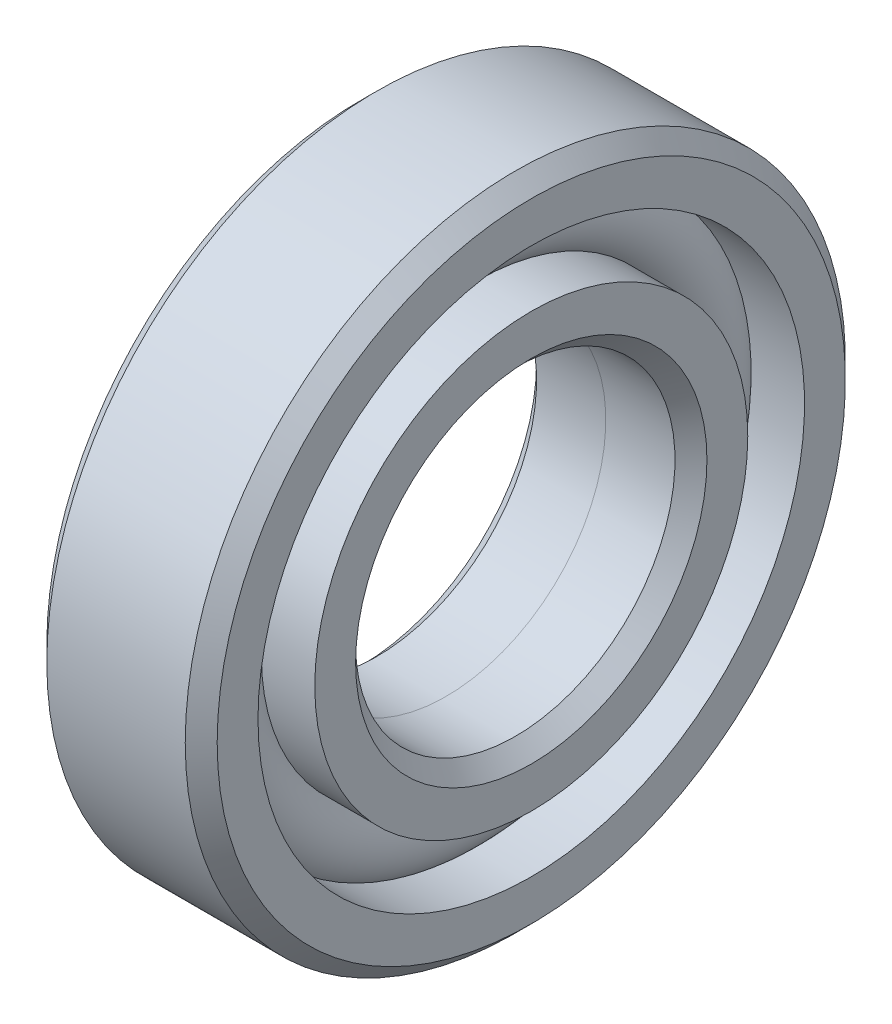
ISO-10303-21;
HEADER;
FILE_DESCRIPTION(('STEP AP214'),'2;1');
FILE_NAME('part.step','',(''),(''),'','','');
FILE_SCHEMA(('AUTOMOTIVE_DESIGN { 1 0 10303 214 1 1 1 1 }'));
ENDSEC;
DATA;
#1=APPLICATION_CONTEXT('core data for automotive mechanical design processes');
#2=APPLICATION_PROTOCOL_DEFINITION('international standard','automotive_design',2000,#1);
#3=PRODUCT_CONTEXT('',#1,'mechanical');
#4=PRODUCT('Part','Part','',(#3));
#5=PRODUCT_RELATED_PRODUCT_CATEGORY('part','',(#4));
#6=PRODUCT_DEFINITION_FORMATION('','',#4);
#7=PRODUCT_DEFINITION_CONTEXT('part definition',#1,'design');
#8=PRODUCT_DEFINITION('design','',#6,#7);
#9=PRODUCT_DEFINITION_SHAPE('','',#8);
#10=(LENGTH_UNIT() NAMED_UNIT(*) SI_UNIT(.MILLI.,.METRE.));
#11=(NAMED_UNIT(*) PLANE_ANGLE_UNIT() SI_UNIT($,.RADIAN.));
#12=(NAMED_UNIT(*) SI_UNIT($,.STERADIAN.) SOLID_ANGLE_UNIT());
#13=UNCERTAINTY_MEASURE_WITH_UNIT(LENGTH_MEASURE(1.E-05),#10,'distance_accuracy_value','');
#14=(GEOMETRIC_REPRESENTATION_CONTEXT(3) GLOBAL_UNCERTAINTY_ASSIGNED_CONTEXT((#13)) GLOBAL_UNIT_ASSIGNED_CONTEXT((#10,
#11,#12)) REPRESENTATION_CONTEXT('',''));
#15=CARTESIAN_POINT('',(0.,0.,0.));
#16=DIRECTION('',(0.,0.,1.));
#17=DIRECTION('',(1.,0.,0.));
#18=AXIS2_PLACEMENT_3D('',#15,#16,#17);
#19=CARTESIAN_POINT('',(8.,0.,0.));
#20=DIRECTION('',(-1.,0.,0.));
#21=DIRECTION('',(0.,0.,1.));
#22=AXIS2_PLACEMENT_3D('',#19,#20,#21);
#23=TOROIDAL_SURFACE('',#22,23.,4.);
#24=CARTESIAN_POINT('',(8.,0.,27.));
#25=VERTEX_POINT('',#24);
#26=VERTEX_LOOP('',#25);
#27=FACE_BOUND('',#26,.T.);
#28=ADVANCED_FACE('F152',(#27),#23,.T.);
#29=CLOSED_SHELL('',(#28));
#30=MANIFOLD_SOLID_BREP('B7',#29);
#31=CARTESIAN_POINT('',(8.,0.,0.));
#32=DIRECTION('',(-1.,0.,0.));
#33=DIRECTION('',(0.,0.,1.));
#34=AXIS2_PLACEMENT_3D('',#31,#32,#33);
#35=TOROIDAL_SURFACE('',#34,23.,4.);
#36=CARTESIAN_POINT('',(5.01857603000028,0.,0.));
#37=DIRECTION('',(-1.,0.,0.));
#38=DIRECTION('',(0.,0.,1.));
#39=AXIS2_PLACEMENT_3D('',#36,#37,#38);
#40=CIRCLE('',#39,25.6666666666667);
#41=CARTESIAN_POINT('',(5.01857603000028,0.,25.6666666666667));
#42=VERTEX_POINT('',#41);
#43=EDGE_CURVE('E215',#42,#42,#40,.T.);
#44=ORIENTED_EDGE('',*,*,#43,.T.);
#45=EDGE_LOOP('',(#44));
#46=FACE_BOUND('',#45,.T.);
#47=CARTESIAN_POINT('',(10.9814239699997,0.,0.));
#48=DIRECTION('',(-1.,0.,0.));
#49=DIRECTION('',(0.,0.,1.));
#50=AXIS2_PLACEMENT_3D('',#47,#48,#49);
#51=CIRCLE('',#50,25.6666666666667);
#52=CARTESIAN_POINT('',(10.9814239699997,0.,25.6666666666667));
#53=VERTEX_POINT('',#52);
#54=EDGE_CURVE('E219',#53,#53,#51,.T.);
#55=ORIENTED_EDGE('',*,*,#54,.F.);
#56=EDGE_LOOP('',(#55));
#57=FACE_BOUND('',#56,.T.);
#58=ADVANCED_FACE('F177',(#46,#57),#35,.F.);
#59=CARTESIAN_POINT('',(0.,0.,0.));
#60=DIRECTION('',(-1.,0.,0.));
#61=DIRECTION('',(0.,0.,1.));
#62=AXIS2_PLACEMENT_3D('',#59,#60,#61);
#63=CYLINDRICAL_SURFACE('',#62,25.6666666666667);
#64=CARTESIAN_POINT('',(16.,0.,0.));
#65=DIRECTION('',(-1.,0.,0.));
#66=DIRECTION('',(0.,0.,1.));
#67=AXIS2_PLACEMENT_3D('',#64,#65,#66);
#68=CIRCLE('',#67,25.6666666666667);
#69=CARTESIAN_POINT('',(16.,0.,25.6666666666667));
#70=VERTEX_POINT('',#69);
#71=EDGE_CURVE('E214',#70,#70,#68,.T.);
#72=ORIENTED_EDGE('',*,*,#71,.F.);
#73=EDGE_LOOP('',(#72));
#74=FACE_BOUND('',#73,.T.);
#75=ORIENTED_EDGE('',*,*,#54,.T.);
#76=EDGE_LOOP('',(#75));
#77=FACE_BOUND('',#76,.T.);
#78=ADVANCED_FACE('F241',(#74,#77),#63,.F.);
#79=CARTESIAN_POINT('',(16.,0.,0.));
#80=DIRECTION('',(-1.,0.,0.));
#81=DIRECTION('',(0.,0.,1.));
#82=AXIS2_PLACEMENT_3D('',#79,#80,#81);
#83=PLANE('',#82);
#84=CARTESIAN_POINT('',(16.,0.,0.));
#85=DIRECTION('',(-1.,0.,0.));
#86=DIRECTION('',(0.,0.,1.));
#87=AXIS2_PLACEMENT_3D('',#84,#85,#86);
#88=CIRCLE('',#87,29.5);
#89=CARTESIAN_POINT('',(16.,0.,29.5));
#90=VERTEX_POINT('',#89);
#91=EDGE_CURVE('E187',#90,#90,#88,.F.);
#92=ORIENTED_EDGE('',*,*,#91,.T.);
#93=EDGE_LOOP('',(#92));
#94=FACE_BOUND('',#93,.T.);
#95=ORIENTED_EDGE('',*,*,#71,.T.);
#96=EDGE_LOOP('',(#95));
#97=FACE_BOUND('',#96,.T.);
#98=ADVANCED_FACE('F247',(#94,#97),#83,.F.);
#99=CARTESIAN_POINT('',(0.,0.,0.));
#100=DIRECTION('',(-1.,0.,0.));
#101=DIRECTION('',(0.,0.,1.));
#102=AXIS2_PLACEMENT_3D('',#99,#100,#101);
#103=CYLINDRICAL_SURFACE('',#102,31.);
#104=CARTESIAN_POINT('',(14.5,0.,0.));
#105=DIRECTION('',(-1.,0.,0.));
#106=DIRECTION('',(0.,0.,1.));
#107=AXIS2_PLACEMENT_3D('',#104,#105,#106);
#108=CIRCLE('',#107,31.);
#109=CARTESIAN_POINT('',(14.5,0.,31.));
#110=VERTEX_POINT('',#109);
#111=EDGE_CURVE('E194',#110,#110,#108,.T.);
#112=ORIENTED_EDGE('',*,*,#111,.T.);
#113=EDGE_LOOP('',(#112));
#114=FACE_BOUND('',#113,.T.);
#115=CARTESIAN_POINT('',(1.50000000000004,0.,0.));
#116=DIRECTION('',(-1.,0.,0.));
#117=DIRECTION('',(0.,0.,1.));
#118=AXIS2_PLACEMENT_3D('',#115,#116,#117);
#119=CIRCLE('',#118,31.);
#120=CARTESIAN_POINT('',(1.50000000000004,0.,31.));
#121=VERTEX_POINT('',#120);
#122=EDGE_CURVE('E199',#121,#121,#119,.F.);
#123=ORIENTED_EDGE('',*,*,#122,.T.);
#124=EDGE_LOOP('',(#123));
#125=FACE_BOUND('',#124,.T.);
#126=ADVANCED_FACE('F230',(#114,#125),#103,.T.);
#127=CARTESIAN_POINT('',(0.,0.,0.));
#128=DIRECTION('',(-1.,0.,0.));
#129=DIRECTION('',(0.,0.,1.));
#130=AXIS2_PLACEMENT_3D('',#127,#128,#129);
#131=PLANE('',#130);
#132=CARTESIAN_POINT('',(0.,0.,0.));
#133=DIRECTION('',(-1.,0.,0.));
#134=DIRECTION('',(0.,0.,1.));
#135=AXIS2_PLACEMENT_3D('',#132,#133,#134);
#136=CIRCLE('',#135,29.5);
#137=CARTESIAN_POINT('',(0.,0.,29.5));
#138=VERTEX_POINT('',#137);
#139=EDGE_CURVE('E151',#138,#138,#136,.T.);
#140=ORIENTED_EDGE('',*,*,#139,.T.);
#141=EDGE_LOOP('',(#140));
#142=FACE_BOUND('',#141,.T.);
#143=CARTESIAN_POINT('',(0.,0.,0.));
#144=DIRECTION('',(-1.,0.,0.));
#145=DIRECTION('',(0.,0.,1.));
#146=AXIS2_PLACEMENT_3D('',#143,#144,#145);
#147=CIRCLE('',#146,25.6666666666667);
#148=CARTESIAN_POINT('',(0.,0.,25.6666666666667));
#149=VERTEX_POINT('',#148);
#150=EDGE_CURVE('E209',#149,#149,#147,.T.);
#151=ORIENTED_EDGE('',*,*,#150,.F.);
#152=EDGE_LOOP('',(#151));
#153=FACE_BOUND('',#152,.T.);
#154=ADVANCED_FACE('F260',(#142,#153),#131,.T.);
#155=CARTESIAN_POINT('',(0.,0.,0.));
#156=DIRECTION('',(-1.,0.,0.));
#157=DIRECTION('',(0.,0.,1.));
#158=AXIS2_PLACEMENT_3D('',#155,#156,#157);
#159=CYLINDRICAL_SURFACE('',#158,25.6666666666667);
#160=ORIENTED_EDGE('',*,*,#43,.F.);
#161=EDGE_LOOP('',(#160));
#162=FACE_BOUND('',#161,.T.);
#163=ORIENTED_EDGE('',*,*,#150,.T.);
#164=EDGE_LOOP('',(#163));
#165=FACE_BOUND('',#164,.T.);
#166=ADVANCED_FACE('F238',(#162,#165),#159,.F.);
#167=CARTESIAN_POINT('',(14.5,0.,0.));
#168=DIRECTION('',(-1.,0.,0.));
#169=DIRECTION('',(0.,0.,1.));
#170=AXIS2_PLACEMENT_3D('',#167,#168,#169);
#171=CONICAL_SURFACE('',#170,31.,0.785398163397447);
#172=ORIENTED_EDGE('',*,*,#91,.F.);
#173=EDGE_LOOP('',(#172));
#174=FACE_BOUND('',#173,.T.);
#175=ORIENTED_EDGE('',*,*,#111,.F.);
#176=EDGE_LOOP('',(#175));
#177=FACE_BOUND('',#176,.T.);
#178=ADVANCED_FACE('F234',(#174,#177),#171,.T.);
#179=CARTESIAN_POINT('',(0.,0.,0.));
#180=DIRECTION('',(1.,0.,0.));
#181=DIRECTION('',(0.,0.,-1.));
#182=AXIS2_PLACEMENT_3D('',#179,#180,#181);
#183=CONICAL_SURFACE('',#182,29.5,0.78539816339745);
#184=ORIENTED_EDGE('',*,*,#122,.F.);
#185=EDGE_LOOP('',(#184));
#186=FACE_BOUND('',#185,.T.);
#187=ORIENTED_EDGE('',*,*,#139,.F.);
#188=EDGE_LOOP('',(#187));
#189=FACE_BOUND('',#188,.T.);
#190=ADVANCED_FACE('F180',(#186,#189),#183,.T.);
#191=CLOSED_SHELL('',(#58,#78,#98,#126,#154,#166,#178,#190));
#192=MANIFOLD_SOLID_BREP('B49',#191);
#193=CARTESIAN_POINT('',(8.,0.,0.));
#194=DIRECTION('',(-1.,0.,0.));
#195=DIRECTION('',(0.,0.,1.));
#196=AXIS2_PLACEMENT_3D('',#193,#194,#195);
#197=TOROIDAL_SURFACE('',#196,23.,4.);
#198=CARTESIAN_POINT('',(10.9814239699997,0.,0.));
#199=DIRECTION('',(-1.,0.,0.));
#200=DIRECTION('',(0.,0.,1.));
#201=AXIS2_PLACEMENT_3D('',#198,#199,#200);
#202=CIRCLE('',#201,20.3333333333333);
#203=CARTESIAN_POINT('',(10.9814239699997,0.,20.3333333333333));
#204=VERTEX_POINT('',#203);
#205=EDGE_CURVE('E377',#204,#204,#202,.T.);
#206=ORIENTED_EDGE('',*,*,#205,.T.);
#207=EDGE_LOOP('',(#206));
#208=FACE_BOUND('',#207,.T.);
#209=CARTESIAN_POINT('',(8.,0.,0.));
#210=DIRECTION('',(-1.,0.,0.));
#211=DIRECTION('',(0.,0.,1.));
#212=AXIS2_PLACEMENT_3D('',#209,#210,#211);
#213=CIRCLE('',#212,19.);
#214=CARTESIAN_POINT('',(8.,0.,19.));
#215=VERTEX_POINT('',#214);
#216=EDGE_CURVE('E356',#215,#215,#213,.T.);
#217=ORIENTED_EDGE('',*,*,#216,.F.);
#218=EDGE_LOOP('',(#217));
#219=FACE_BOUND('',#218,.T.);
#220=ADVANCED_FACE('F342',(#208,#219),#197,.F.);
#221=CARTESIAN_POINT('',(8.,0.,0.));
#222=DIRECTION('',(1.,0.,0.));
#223=DIRECTION('',(0.,0.,-1.));
#224=AXIS2_PLACEMENT_3D('',#221,#222,#223);
#225=PLANE('',#224);
#226=CARTESIAN_POINT('',(8.,0.,0.));
#227=DIRECTION('',(-1.,0.,0.));
#228=DIRECTION('',(0.,0.,1.));
#229=AXIS2_PLACEMENT_3D('',#226,#227,#228);
#230=CIRCLE('',#229,15.);
#231=CARTESIAN_POINT('',(8.,0.,15.));
#232=VERTEX_POINT('',#231);
#233=EDGE_CURVE('E362',#232,#232,#230,.T.);
#234=ORIENTED_EDGE('',*,*,#233,.F.);
#235=EDGE_LOOP('',(#234));
#236=FACE_BOUND('',#235,.T.);
#237=ORIENTED_EDGE('',*,*,#216,.T.);
#238=EDGE_LOOP('',(#237));
#239=FACE_BOUND('',#238,.T.);
#240=ADVANCED_FACE('F399',(#236,#239),#225,.F.);
#241=CARTESIAN_POINT('',(0.,0.,0.));
#242=DIRECTION('',(-1.,0.,0.));
#243=DIRECTION('',(0.,0.,1.));
#244=AXIS2_PLACEMENT_3D('',#241,#242,#243);
#245=CYLINDRICAL_SURFACE('',#244,15.);
#246=CARTESIAN_POINT('',(14.5,0.,0.));
#247=DIRECTION('',(-1.,0.,0.));
#248=DIRECTION('',(0.,0.,1.));
#249=AXIS2_PLACEMENT_3D('',#246,#247,#248);
#250=CIRCLE('',#249,15.);
#251=CARTESIAN_POINT('',(14.5,0.,15.));
#252=VERTEX_POINT('',#251);
#253=EDGE_CURVE('E176',#252,#252,#250,.F.);
#254=ORIENTED_EDGE('',*,*,#253,.T.);
#255=EDGE_LOOP('',(#254));
#256=FACE_BOUND('',#255,.T.);
#257=ORIENTED_EDGE('',*,*,#233,.T.);
#258=EDGE_LOOP('',(#257));
#259=FACE_BOUND('',#258,.T.);
#260=ADVANCED_FACE('F395',(#256,#259),#245,.F.);
#261=CARTESIAN_POINT('',(16.,0.,0.));
#262=DIRECTION('',(-1.,0.,0.));
#263=DIRECTION('',(0.,0.,1.));
#264=AXIS2_PLACEMENT_3D('',#261,#262,#263);
#265=PLANE('',#264);
#266=CARTESIAN_POINT('',(16.,0.,0.));
#267=DIRECTION('',(-1.,0.,0.));
#268=DIRECTION('',(0.,0.,1.));
#269=AXIS2_PLACEMENT_3D('',#266,#267,#268);
#270=CIRCLE('',#269,16.5);
#271=CARTESIAN_POINT('',(16.,0.,16.5));
#272=VERTEX_POINT('',#271);
#273=EDGE_CURVE('E351',#272,#272,#270,.T.);
#274=ORIENTED_EDGE('',*,*,#273,.T.);
#275=EDGE_LOOP('',(#274));
#276=FACE_BOUND('',#275,.T.);
#277=CARTESIAN_POINT('',(16.,0.,0.));
#278=DIRECTION('',(-1.,0.,0.));
#279=DIRECTION('',(0.,0.,1.));
#280=AXIS2_PLACEMENT_3D('',#277,#278,#279);
#281=CIRCLE('',#280,20.3333333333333);
#282=CARTESIAN_POINT('',(16.,0.,20.3333333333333));
#283=VERTEX_POINT('',#282);
#284=EDGE_CURVE('E372',#283,#283,#281,.T.);
#285=ORIENTED_EDGE('',*,*,#284,.F.);
#286=EDGE_LOOP('',(#285));
#287=FACE_BOUND('',#286,.T.);
#288=ADVANCED_FACE('F387',(#276,#287),#265,.F.);
#289=CARTESIAN_POINT('',(0.,0.,0.));
#290=DIRECTION('',(-1.,0.,0.));
#291=DIRECTION('',(0.,0.,1.));
#292=AXIS2_PLACEMENT_3D('',#289,#290,#291);
#293=CYLINDRICAL_SURFACE('',#292,20.3333333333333);
#294=ORIENTED_EDGE('',*,*,#284,.T.);
#295=EDGE_LOOP('',(#294));
#296=FACE_BOUND('',#295,.T.);
#297=ORIENTED_EDGE('',*,*,#205,.F.);
#298=EDGE_LOOP('',(#297));
#299=FACE_BOUND('',#298,.T.);
#300=ADVANCED_FACE('F385',(#296,#299),#293,.T.);
#301=CARTESIAN_POINT('',(16.,0.,0.));
#302=DIRECTION('',(1.,0.,0.));
#303=DIRECTION('',(0.,0.,-1.));
#304=AXIS2_PLACEMENT_3D('',#301,#302,#303);
#305=CONICAL_SURFACE('',#304,16.5,0.785398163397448);
#306=ORIENTED_EDGE('',*,*,#253,.F.);
#307=EDGE_LOOP('',(#306));
#308=FACE_BOUND('',#307,.T.);
#309=ORIENTED_EDGE('',*,*,#273,.F.);
#310=EDGE_LOOP('',(#309));
#311=FACE_BOUND('',#310,.T.);
#312=ADVANCED_FACE('F345',(#308,#311),#305,.F.);
#313=CLOSED_SHELL('',(#220,#240,#260,#288,#300,#312));
#314=MANIFOLD_SOLID_BREP('B146',#313);
#315=CARTESIAN_POINT('',(8.,0.,0.));
#316=DIRECTION('',(-1.,0.,0.));
#317=DIRECTION('',(0.,0.,1.));
#318=AXIS2_PLACEMENT_3D('',#315,#316,#317);
#319=TOROIDAL_SURFACE('',#318,23.,4.);
#320=CARTESIAN_POINT('',(8.,0.,0.));
#321=DIRECTION('',(-1.,0.,0.));
#322=DIRECTION('',(0.,0.,1.));
#323=AXIS2_PLACEMENT_3D('',#320,#321,#322);
#324=CIRCLE('',#323,19.);
#325=CARTESIAN_POINT('',(8.,0.,19.));
#326=VERTEX_POINT('',#325);
#327=EDGE_CURVE('E493',#326,#326,#324,.T.);
#328=ORIENTED_EDGE('',*,*,#327,.T.);
#329=EDGE_LOOP('',(#328));
#330=FACE_BOUND('',#329,.T.);
#331=CARTESIAN_POINT('',(5.01857603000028,0.,0.));
#332=DIRECTION('',(-1.,0.,0.));
#333=DIRECTION('',(0.,0.,1.));
#334=AXIS2_PLACEMENT_3D('',#331,#332,#333);
#335=CIRCLE('',#334,20.3333333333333);
#336=CARTESIAN_POINT('',(5.01857603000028,0.,20.3333333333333));
#337=VERTEX_POINT('',#336);
#338=EDGE_CURVE('E474',#337,#337,#335,.T.);
#339=ORIENTED_EDGE('',*,*,#338,.F.);
#340=EDGE_LOOP('',(#339));
#341=FACE_BOUND('',#340,.T.);
#342=ADVANCED_FACE('F460',(#330,#341),#319,.F.);
#343=CARTESIAN_POINT('',(0.,0.,0.));
#344=DIRECTION('',(-1.,0.,0.));
#345=DIRECTION('',(0.,0.,1.));
#346=AXIS2_PLACEMENT_3D('',#343,#344,#345);
#347=CYLINDRICAL_SURFACE('',#346,20.3333333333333);
#348=ORIENTED_EDGE('',*,*,#338,.T.);
#349=EDGE_LOOP('',(#348));
#350=FACE_BOUND('',#349,.T.);
#351=CARTESIAN_POINT('',(0.,0.,0.));
#352=DIRECTION('',(-1.,0.,0.));
#353=DIRECTION('',(0.,0.,1.));
#354=AXIS2_PLACEMENT_3D('',#351,#352,#353);
#355=CIRCLE('',#354,20.3333333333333);
#356=CARTESIAN_POINT('',(0.,0.,20.3333333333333));
#357=VERTEX_POINT('',#356);
#358=EDGE_CURVE('E480',#357,#357,#355,.T.);
#359=ORIENTED_EDGE('',*,*,#358,.F.);
#360=EDGE_LOOP('',(#359));
#361=FACE_BOUND('',#360,.T.);
#362=ADVANCED_FACE('F501',(#350,#361),#347,.T.);
#363=CARTESIAN_POINT('',(0.,0.,0.));
#364=DIRECTION('',(-1.,0.,0.));
#365=DIRECTION('',(0.,0.,1.));
#366=AXIS2_PLACEMENT_3D('',#363,#364,#365);
#367=PLANE('',#366);
#368=CARTESIAN_POINT('',(0.,0.,0.));
#369=DIRECTION('',(-1.,0.,0.));
#370=DIRECTION('',(0.,0.,1.));
#371=AXIS2_PLACEMENT_3D('',#368,#369,#370);
#372=CIRCLE('',#371,16.5);
#373=CARTESIAN_POINT('',(0.,0.,16.5));
#374=VERTEX_POINT('',#373);
#375=EDGE_CURVE('E341',#374,#374,#372,.F.);
#376=ORIENTED_EDGE('',*,*,#375,.T.);
#377=EDGE_LOOP('',(#376));
#378=FACE_BOUND('',#377,.T.);
#379=ORIENTED_EDGE('',*,*,#358,.T.);
#380=EDGE_LOOP('',(#379));
#381=FACE_BOUND('',#380,.T.);
#382=ADVANCED_FACE('F499',(#378,#381),#367,.T.);
#383=CARTESIAN_POINT('',(0.,0.,0.));
#384=DIRECTION('',(-1.,0.,0.));
#385=DIRECTION('',(0.,0.,1.));
#386=AXIS2_PLACEMENT_3D('',#383,#384,#385);
#387=CYLINDRICAL_SURFACE('',#386,15.);
#388=CARTESIAN_POINT('',(1.5,0.,0.));
#389=DIRECTION('',(-1.,0.,0.));
#390=DIRECTION('',(0.,0.,1.));
#391=AXIS2_PLACEMENT_3D('',#388,#389,#390);
#392=CIRCLE('',#391,15.);
#393=CARTESIAN_POINT('',(1.5,0.,15.));
#394=VERTEX_POINT('',#393);
#395=EDGE_CURVE('E469',#394,#394,#392,.T.);
#396=ORIENTED_EDGE('',*,*,#395,.T.);
#397=EDGE_LOOP('',(#396));
#398=FACE_BOUND('',#397,.T.);
#399=CARTESIAN_POINT('',(8.,0.,0.));
#400=DIRECTION('',(-1.,0.,0.));
#401=DIRECTION('',(0.,0.,1.));
#402=AXIS2_PLACEMENT_3D('',#399,#400,#401);
#403=CIRCLE('',#402,15.);
#404=CARTESIAN_POINT('',(8.,0.,15.));
#405=VERTEX_POINT('',#404);
#406=EDGE_CURVE('E489',#405,#405,#403,.T.);
#407=ORIENTED_EDGE('',*,*,#406,.F.);
#408=EDGE_LOOP('',(#407));
#409=FACE_BOUND('',#408,.T.);
#410=ADVANCED_FACE('F509',(#398,#409),#387,.F.);
#411=CARTESIAN_POINT('',(8.,0.,0.));
#412=DIRECTION('',(1.,0.,0.));
#413=DIRECTION('',(0.,0.,-1.));
#414=AXIS2_PLACEMENT_3D('',#411,#412,#413);
#415=PLANE('',#414);
#416=ORIENTED_EDGE('',*,*,#406,.T.);
#417=EDGE_LOOP('',(#416));
#418=FACE_BOUND('',#417,.T.);
#419=ORIENTED_EDGE('',*,*,#327,.F.);
#420=EDGE_LOOP('',(#419));
#421=FACE_BOUND('',#420,.T.);
#422=ADVANCED_FACE('F519',(#418,#421),#415,.T.);
#423=CARTESIAN_POINT('',(1.5,0.,0.));
#424=DIRECTION('',(-1.,0.,0.));
#425=DIRECTION('',(0.,0.,1.));
#426=AXIS2_PLACEMENT_3D('',#423,#424,#425);
#427=CONICAL_SURFACE('',#426,15.,0.785398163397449);
#428=ORIENTED_EDGE('',*,*,#375,.F.);
#429=EDGE_LOOP('',(#428));
#430=FACE_BOUND('',#429,.T.);
#431=ORIENTED_EDGE('',*,*,#395,.F.);
#432=EDGE_LOOP('',(#431));
#433=FACE_BOUND('',#432,.T.);
#434=ADVANCED_FACE('F463',(#430,#433),#427,.F.);
#435=CLOSED_SHELL('',(#342,#362,#382,#410,#422,#434));
#436=MANIFOLD_SOLID_BREP('B171',#435);
#437=ADVANCED_BREP_SHAPE_REPRESENTATION('',(#18,#30,#192,#314,#436),#14);
#438=SHAPE_DEFINITION_REPRESENTATION(#9,#437);
ENDSEC;
END-ISO-10303-21;
